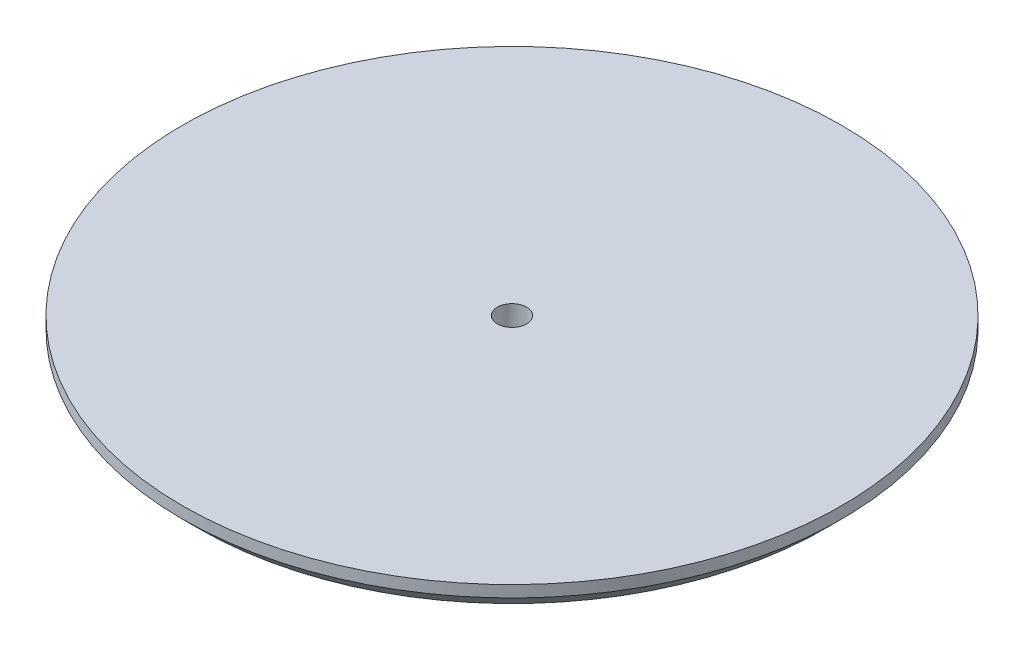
ISO-10303-21;
HEADER;
FILE_DESCRIPTION(('STEP AP214'),'2;1');
FILE_NAME('part.step','',(''),(''),'','','');
FILE_SCHEMA(('AUTOMOTIVE_DESIGN { 1 0 10303 214 1 1 1 1 }'));
ENDSEC;
DATA;
#1=APPLICATION_CONTEXT('core data for automotive mechanical design processes');
#2=APPLICATION_PROTOCOL_DEFINITION('international standard','automotive_design',2000,#1);
#3=PRODUCT_CONTEXT('',#1,'mechanical');
#4=PRODUCT('Part','Part','',(#3));
#5=PRODUCT_RELATED_PRODUCT_CATEGORY('part','',(#4));
#6=PRODUCT_DEFINITION_FORMATION('','',#4);
#7=PRODUCT_DEFINITION_CONTEXT('part definition',#1,'design');
#8=PRODUCT_DEFINITION('design','',#6,#7);
#9=PRODUCT_DEFINITION_SHAPE('','',#8);
#10=(LENGTH_UNIT() NAMED_UNIT(*) SI_UNIT(.MILLI.,.METRE.));
#11=(NAMED_UNIT(*) PLANE_ANGLE_UNIT() SI_UNIT($,.RADIAN.));
#12=(NAMED_UNIT(*) SI_UNIT($,.STERADIAN.) SOLID_ANGLE_UNIT());
#13=UNCERTAINTY_MEASURE_WITH_UNIT(LENGTH_MEASURE(1.E-05),#10,'distance_accuracy_value','');
#14=(GEOMETRIC_REPRESENTATION_CONTEXT(3) GLOBAL_UNCERTAINTY_ASSIGNED_CONTEXT((#13)) GLOBAL_UNIT_ASSIGNED_CONTEXT((#10,
#11,#12)) REPRESENTATION_CONTEXT('',''));
#15=CARTESIAN_POINT('',(0.,0.,0.));
#16=DIRECTION('',(0.,0.,1.));
#17=DIRECTION('',(1.,0.,0.));
#18=AXIS2_PLACEMENT_3D('',#15,#16,#17);
#19=CARTESIAN_POINT('',(66.4644660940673,0.,0.));
#20=DIRECTION('',(0.,1.,0.));
#21=DIRECTION('',(0.,0.,1.));
#22=AXIS2_PLACEMENT_3D('',#19,#20,#21);
#23=PLANE('',#22);
#24=CARTESIAN_POINT('',(0.,0.,0.));
#25=DIRECTION('',(0.,1.,0.));
#26=DIRECTION('',(0.,0.,1.));
#27=AXIS2_PLACEMENT_3D('',#24,#25,#26);
#28=CIRCLE('',#27,3.1);
#29=CARTESIAN_POINT('',(0.,0.,3.1));
#30=VERTEX_POINT('',#29);
#31=EDGE_CURVE('E43',#30,#30,#28,.T.);
#32=ORIENTED_EDGE('',*,*,#31,.T.);
#33=EDGE_LOOP('',(#32));
#34=FACE_BOUND('',#33,.T.);
#35=CARTESIAN_POINT('',(0.,0.,0.));
#36=DIRECTION('',(0.,1.,0.));
#37=DIRECTION('',(0.,0.,1.));
#38=AXIS2_PLACEMENT_3D('',#35,#36,#37);
#39=CIRCLE('',#38,66.4644660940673);
#40=CARTESIAN_POINT('',(0.,0.,66.4644660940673));
#41=VERTEX_POINT('',#40);
#42=EDGE_CURVE('E10',#41,#41,#39,.T.);
#43=ORIENTED_EDGE('',*,*,#42,.F.);
#44=EDGE_LOOP('',(#43));
#45=FACE_BOUND('',#44,.T.);
#46=ADVANCED_FACE('F29',(#34,#45),#23,.F.);
#47=CARTESIAN_POINT('',(0.,0.,0.));
#48=DIRECTION('',(0.,1.,0.));
#49=DIRECTION('',(0.,0.,1.));
#50=AXIS2_PLACEMENT_3D('',#47,#48,#49);
#51=CONICAL_SURFACE('',#50,66.4644660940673,0.785398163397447);
#52=CARTESIAN_POINT('',(0.,3.53553390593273,0.));
#53=DIRECTION('',(0.,1.,0.));
#54=DIRECTION('',(0.,0.,1.));
#55=AXIS2_PLACEMENT_3D('',#52,#53,#54);
#56=CIRCLE('',#55,70.);
#57=CARTESIAN_POINT('',(0.,3.53553390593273,70.));
#58=VERTEX_POINT('',#57);
#59=EDGE_CURVE('E35',#58,#58,#56,.T.);
#60=ORIENTED_EDGE('',*,*,#59,.F.);
#61=EDGE_LOOP('',(#60));
#62=FACE_BOUND('',#61,.T.);
#63=ORIENTED_EDGE('',*,*,#42,.T.);
#64=EDGE_LOOP('',(#63));
#65=FACE_BOUND('',#64,.T.);
#66=ADVANCED_FACE('F62',(#62,#65),#51,.T.);
#67=CARTESIAN_POINT('',(0.,18.0759168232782,0.));
#68=DIRECTION('',(0.,1.,0.));
#69=DIRECTION('',(0.,0.,1.));
#70=AXIS2_PLACEMENT_3D('',#67,#68,#69);
#71=CYLINDRICAL_SURFACE('',#70,70.);
#72=CARTESIAN_POINT('',(0.,6.,0.));
#73=DIRECTION('',(0.,1.,0.));
#74=DIRECTION('',(0.,0.,1.));
#75=AXIS2_PLACEMENT_3D('',#72,#73,#74);
#76=CIRCLE('',#75,70.);
#77=CARTESIAN_POINT('',(0.,6.,70.));
#78=VERTEX_POINT('',#77);
#79=EDGE_CURVE('E39',#78,#78,#76,.T.);
#80=ORIENTED_EDGE('',*,*,#79,.F.);
#81=EDGE_LOOP('',(#80));
#82=FACE_BOUND('',#81,.T.);
#83=ORIENTED_EDGE('',*,*,#59,.T.);
#84=EDGE_LOOP('',(#83));
#85=FACE_BOUND('',#84,.T.);
#86=ADVANCED_FACE('F57',(#82,#85),#71,.T.);
#87=CARTESIAN_POINT('',(35.,5.99999999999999,0.));
#88=DIRECTION('',(0.,-1.,0.));
#89=DIRECTION('',(0.,0.,-1.));
#90=AXIS2_PLACEMENT_3D('',#87,#88,#89);
#91=PLANE('',#90);
#92=CARTESIAN_POINT('',(0.,5.99999999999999,0.));
#93=DIRECTION('',(0.,1.,0.));
#94=DIRECTION('',(0.,0.,1.));
#95=AXIS2_PLACEMENT_3D('',#92,#93,#94);
#96=CIRCLE('',#95,3.1);
#97=CARTESIAN_POINT('',(0.,5.99999999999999,3.1));
#98=VERTEX_POINT('',#97);
#99=EDGE_CURVE('E48',#98,#98,#96,.T.);
#100=ORIENTED_EDGE('',*,*,#99,.F.);
#101=EDGE_LOOP('',(#100));
#102=FACE_BOUND('',#101,.T.);
#103=ORIENTED_EDGE('',*,*,#79,.T.);
#104=EDGE_LOOP('',(#103));
#105=FACE_BOUND('',#104,.T.);
#106=ADVANCED_FACE('F54',(#102,#105),#91,.F.);
#107=CARTESIAN_POINT('',(0.,0.,0.));
#108=DIRECTION('',(0.,1.,0.));
#109=DIRECTION('',(0.,0.,1.));
#110=AXIS2_PLACEMENT_3D('',#107,#108,#109);
#111=CYLINDRICAL_SURFACE('',#110,3.1);
#112=ORIENTED_EDGE('',*,*,#31,.F.);
#113=EDGE_LOOP('',(#112));
#114=FACE_BOUND('',#113,.T.);
#115=ORIENTED_EDGE('',*,*,#99,.T.);
#116=EDGE_LOOP('',(#115));
#117=FACE_BOUND('',#116,.T.);
#118=ADVANCED_FACE('F52',(#114,#117),#111,.F.);
#119=CLOSED_SHELL('',(#46,#66,#86,#106,#118));
#120=MANIFOLD_SOLID_BREP('B2',#119);
#121=ADVANCED_BREP_SHAPE_REPRESENTATION('',(#18,#120),#14);
#122=SHAPE_DEFINITION_REPRESENTATION(#9,#121);
ENDSEC;
END-ISO-10303-21;
